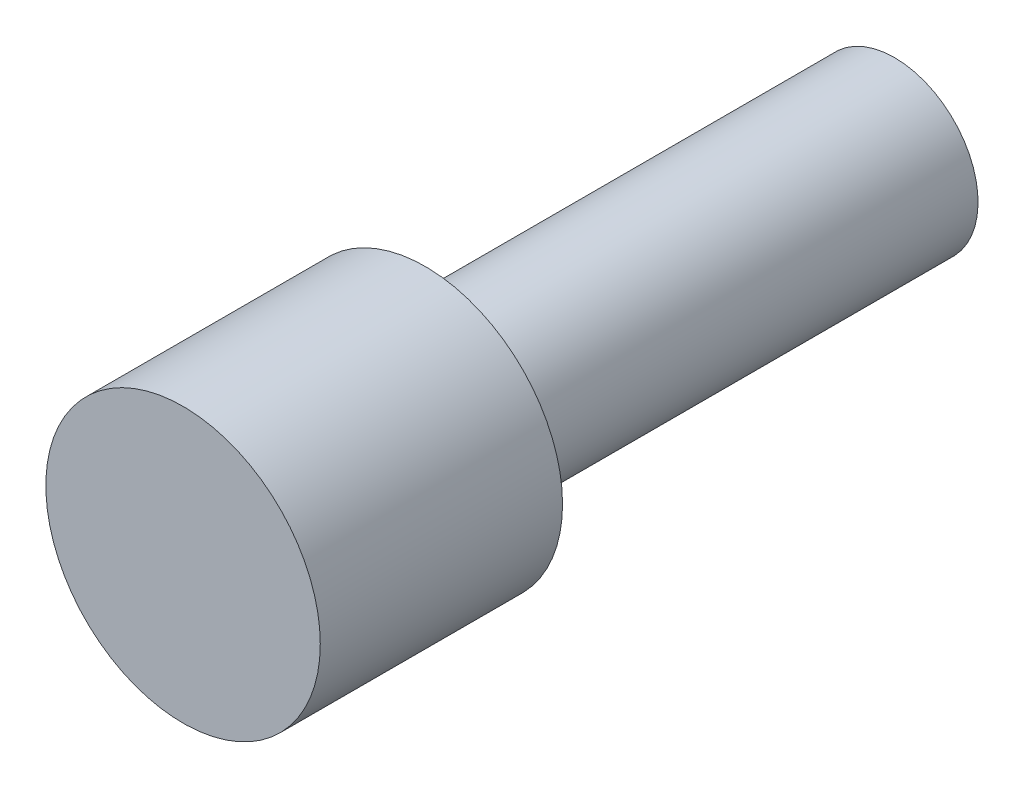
ISO-10303-21;
HEADER;
FILE_DESCRIPTION(('STEP AP214'),'2;1');
FILE_NAME('part.step','',(''),(''),'','','');
FILE_SCHEMA(('AUTOMOTIVE_DESIGN { 1 0 10303 214 1 1 1 1 }'));
ENDSEC;
DATA;
#1=APPLICATION_CONTEXT('core data for automotive mechanical design processes');
#2=APPLICATION_PROTOCOL_DEFINITION('international standard','automotive_design',2000,#1);
#3=PRODUCT_CONTEXT('',#1,'mechanical');
#4=PRODUCT('Part','Part','',(#3));
#5=PRODUCT_RELATED_PRODUCT_CATEGORY('part','',(#4));
#6=PRODUCT_DEFINITION_FORMATION('','',#4);
#7=PRODUCT_DEFINITION_CONTEXT('part definition',#1,'design');
#8=PRODUCT_DEFINITION('design','',#6,#7);
#9=PRODUCT_DEFINITION_SHAPE('','',#8);
#10=(LENGTH_UNIT() NAMED_UNIT(*) SI_UNIT(.MILLI.,.METRE.));
#11=(NAMED_UNIT(*) PLANE_ANGLE_UNIT() SI_UNIT($,.RADIAN.));
#12=(NAMED_UNIT(*) SI_UNIT($,.STERADIAN.) SOLID_ANGLE_UNIT());
#13=UNCERTAINTY_MEASURE_WITH_UNIT(LENGTH_MEASURE(1.E-05),#10,'distance_accuracy_value','');
#14=(GEOMETRIC_REPRESENTATION_CONTEXT(3) GLOBAL_UNCERTAINTY_ASSIGNED_CONTEXT((#13)) GLOBAL_UNIT_ASSIGNED_CONTEXT((#10,
#11,#12)) REPRESENTATION_CONTEXT('',''));
#15=CARTESIAN_POINT('',(0.,0.,0.));
#16=DIRECTION('',(0.,0.,1.));
#17=DIRECTION('',(1.,0.,0.));
#18=AXIS2_PLACEMENT_3D('',#15,#16,#17);
#19=CARTESIAN_POINT('',(0.,0.,-14.3000000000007));
#20=DIRECTION('',(0.,0.,1.));
#21=DIRECTION('',(1.,0.,0.));
#22=AXIS2_PLACEMENT_3D('',#19,#20,#21);
#23=CYLINDRICAL_SURFACE('',#22,8.09999999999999);
#24=CARTESIAN_POINT('',(0.,0.,-14.3000000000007));
#25=DIRECTION('',(0.,0.,1.));
#26=DIRECTION('',(1.,0.,0.));
#27=AXIS2_PLACEMENT_3D('',#24,#25,#26);
#28=CIRCLE('',#27,8.09999999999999);
#29=CARTESIAN_POINT('',(8.10000000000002,0.,-14.3000000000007));
#30=VERTEX_POINT('',#29);
#31=EDGE_CURVE('E40',#30,#30,#28,.T.);
#32=ORIENTED_EDGE('',*,*,#31,.T.);
#33=EDGE_LOOP('',(#32));
#34=FACE_BOUND('',#33,.T.);
#35=CARTESIAN_POINT('',(0.,0.,0.));
#36=DIRECTION('',(0.,0.,1.));
#37=DIRECTION('',(1.,0.,0.));
#38=AXIS2_PLACEMENT_3D('',#35,#36,#37);
#39=CIRCLE('',#38,8.09999999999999);
#40=CARTESIAN_POINT('',(8.10000000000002,0.,0.));
#41=VERTEX_POINT('',#40);
#42=EDGE_CURVE('E36',#41,#41,#39,.T.);
#43=ORIENTED_EDGE('',*,*,#42,.F.);
#44=EDGE_LOOP('',(#43));
#45=FACE_BOUND('',#44,.T.);
#46=ADVANCED_FACE('F33',(#34,#45),#23,.T.);
#47=CARTESIAN_POINT('',(0.,0.,-14.3000000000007));
#48=DIRECTION('',(0.,0.,1.));
#49=DIRECTION('',(1.,0.,0.));
#50=AXIS2_PLACEMENT_3D('',#47,#48,#49);
#51=PLANE('',#50);
#52=CARTESIAN_POINT('',(-1.75839128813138E-05,0.000109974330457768,-14.3000000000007));
#53=DIRECTION('',(0.,0.,-1.));
#54=DIRECTION('',(-1.,0.,0.));
#55=AXIS2_PLACEMENT_3D('',#52,#53,#54);
#56=CIRCLE('',#55,4.9265);
#57=CARTESIAN_POINT('',(-4.92651758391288,0.000109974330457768,-14.3000000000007));
#58=VERTEX_POINT('',#57);
#59=EDGE_CURVE('E10',#58,#58,#56,.T.);
#60=ORIENTED_EDGE('',*,*,#59,.F.);
#61=EDGE_LOOP('',(#60));
#62=FACE_BOUND('',#61,.T.);
#63=ORIENTED_EDGE('',*,*,#31,.F.);
#64=EDGE_LOOP('',(#63));
#65=FACE_BOUND('',#64,.T.);
#66=ADVANCED_FACE('F56',(#62,#65),#51,.F.);
#67=CARTESIAN_POINT('',(0.,0.,0.));
#68=DIRECTION('',(0.,0.,1.));
#69=DIRECTION('',(1.,0.,0.));
#70=AXIS2_PLACEMENT_3D('',#67,#68,#69);
#71=PLANE('',#70);
#72=ORIENTED_EDGE('',*,*,#42,.T.);
#73=EDGE_LOOP('',(#72));
#74=FACE_BOUND('',#73,.T.);
#75=ADVANCED_FACE('F53',(#74),#71,.T.);
#76=CARTESIAN_POINT('',(-1.75839128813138E-05,0.000109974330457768,-55.9342462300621));
#77=DIRECTION('',(0.,0.,1.));
#78=DIRECTION('',(1.,0.,0.));
#79=AXIS2_PLACEMENT_3D('',#76,#77,#78);
#80=CYLINDRICAL_SURFACE('',#79,4.9265);
#81=ORIENTED_EDGE('',*,*,#59,.T.);
#82=EDGE_LOOP('',(#81));
#83=FACE_BOUND('',#82,.T.);
#84=CARTESIAN_POINT('',(-1.75839128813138E-05,0.000109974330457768,-42.));
#85=DIRECTION('',(0.,0.,-1.));
#86=DIRECTION('',(0.,1.,0.));
#87=AXIS2_PLACEMENT_3D('',#84,#85,#86);
#88=CIRCLE('',#87,4.9265);
#89=CARTESIAN_POINT('',(-1.75839128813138E-05,4.92660997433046,-42.));
#90=VERTEX_POINT('',#89);
#91=EDGE_CURVE('E46',#90,#90,#88,.T.);
#92=ORIENTED_EDGE('',*,*,#91,.F.);
#93=EDGE_LOOP('',(#92));
#94=FACE_BOUND('',#93,.T.);
#95=ADVANCED_FACE('F68',(#83,#94),#80,.T.);
#96=CARTESIAN_POINT('',(0.,0.,-42.));
#97=DIRECTION('',(0.,0.,-1.));
#98=DIRECTION('',(-1.,0.,0.));
#99=AXIS2_PLACEMENT_3D('',#96,#97,#98);
#100=PLANE('',#99);
#101=ORIENTED_EDGE('',*,*,#91,.T.);
#102=EDGE_LOOP('',(#101));
#103=FACE_BOUND('',#102,.T.);
#104=ADVANCED_FACE('F70',(#103),#100,.T.);
#105=CLOSED_SHELL('',(#46,#66,#75,#95,#104));
#106=MANIFOLD_SOLID_BREP('B2',#105);
#107=ADVANCED_BREP_SHAPE_REPRESENTATION('',(#18,#106),#14);
#108=SHAPE_DEFINITION_REPRESENTATION(#9,#107);
ENDSEC;
END-ISO-10303-21;
